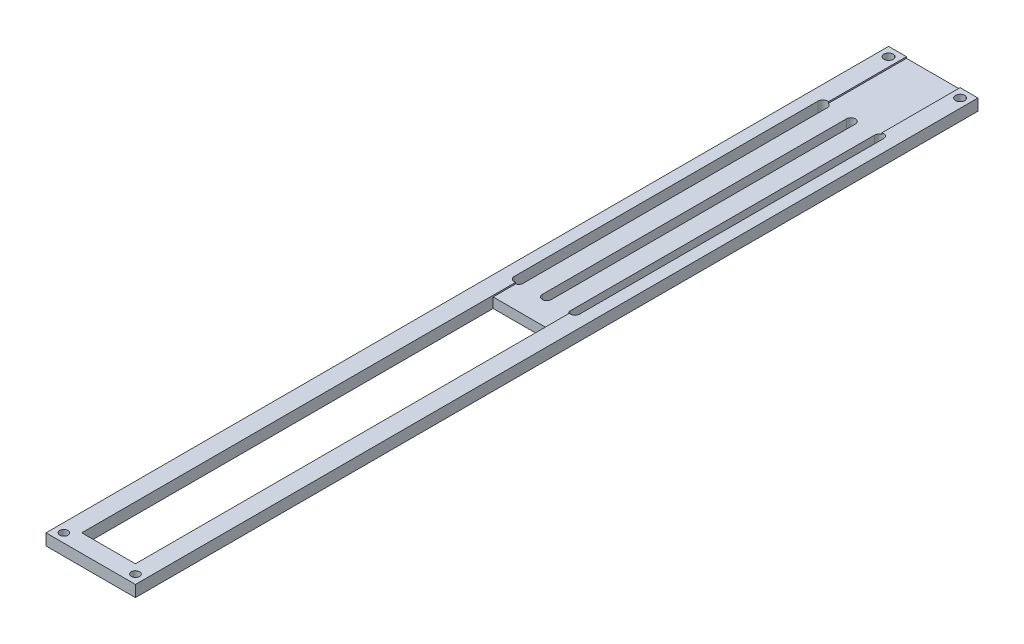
from build123d import *

# Parameters (mm, degrees)
SKETCH1_W                 = 31.75
SKETCH1_H                 = 4.064
BOSS_EXTRUDE1_DEPTH       = 308.6608
SKETCH2_W                 = 19.05
SKETCH2_H                 = 146.05
CUT_EXTRUDE2_DEPTH        = 6.35
SKETCH3_W                 = 19.05
SKETCH3_H                 = 154.533555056
CUT_EXTRUDE3_DEPTH        = 0.508
F_4_CLEARANCE_HOLE1_D     = 2.9464
F_4_CLEARANCE_HOLE1_DEPTH = 25.4
F_4_CLEARANCE_HOLE1_TIP   = 0.885187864
CUT_EXTRUDE4_DEPTH        = 8.128
LPATTERN1_COUNT           = 2
LPATTERN1_PITCH           = 10
LPATTERN2_COUNT           = 2
LPATTERN2_PITCH           = 10
F_4_CLEARANCE_HOLE2_D     = 3.2639
F_4_CLEARANCE_HOLE2_DEPTH = 25.4
F_4_CLEARANCE_HOLE2_TIP   = 0.980574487
SKETCH9_W                 = 36.705635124
SKETCH9_H                 = 8.678632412
CUT_EXTRUDE5_DEPTH        = 9.525


with BuildPart() as part:
    # Sketch1 → Boss-Extrude1 (new body)
    with BuildSketch(Plane.XY):
        Rectangle(SKETCH1_W, SKETCH1_H)
    extrude(amount=BOSS_EXTRUDE1_DEPTH)

    # Sketch2 → Cut-Extrude2 (cut)
    with BuildSketch(Plane(origin=(0, 2.032, 0), x_dir=(1, 0, 0), z_dir=(0, 1, 0))):
        with Locations((0, -219.7608)):
            Rectangle(SKETCH2_W, SKETCH2_H)
    extrude(amount=-CUT_EXTRUDE2_DEPTH, mode=Mode.SUBTRACT)

    # Sketch3 → Cut-Extrude3 (cut)
    with BuildSketch(Plane(origin=(0, 2.032, 0), x_dir=(1, 0, 0), z_dir=(0, 1, 0))):
        with Locations((0, -69.469022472)):
            Rectangle(SKETCH3_W, SKETCH3_H)
    extrude(amount=-CUT_EXTRUDE3_DEPTH, mode=Mode.SUBTRACT)

    # 4 Clearance Hole1
    with Locations(Plane(origin=(0, 2.032, 0), x_dir=(1, 0, 0), z_dir=(0, 1, 0))):
        with Locations((12.7, -295.9608), (-12.7, -295.9608)):
            Hole(F_4_CLEARANCE_HOLE1_D / 2, depth=F_4_CLEARANCE_HOLE1_DEPTH)
            with Locations((0, 0, -(F_4_CLEARANCE_HOLE1_DEPTH + F_4_CLEARANCE_HOLE1_TIP / 2))):  # 118° drill point
                Cone(0, F_4_CLEARANCE_HOLE1_D / 2, F_4_CLEARANCE_HOLE1_TIP, mode=Mode.SUBTRACT)

    # Sketch6 → Cut-Extrude4 (cut)
    with BuildSketch(Plane.XZ.offset(2.032)):
        with BuildLine():
            Line((1.614488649, 137.2108), (1.614488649, 29.2608))
            ThreePointArc((1.614488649, 29.2608), (0.014488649, 27.6608), (-1.585511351, 29.2608))
            Line((-1.585511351, 29.2608), (-1.585511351, 137.2108))
            ThreePointArc((-1.585511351, 137.2108), (0.014488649, 138.8108), (1.614488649, 137.2108))
        make_face()
    cut_extrude4 = extrude(amount=-CUT_EXTRUDE4_DEPTH, mode=Mode.SUBTRACT)

    # LPattern1: Cut-Extrude4 ×2
    with Locations(*[(-i * LPATTERN1_PITCH, 0, 0) for i in range(1, LPATTERN1_COUNT)]):
        add(cut_extrude4, mode=Mode.SUBTRACT)

    # LPattern2: Cut-Extrude4 ×2
    with Locations(*[(i * LPATTERN2_PITCH, 0, 0) for i in range(1, LPATTERN2_COUNT)]):
        add(cut_extrude4, mode=Mode.SUBTRACT)

    # 4 Clearance Hole2
    with Locations(Plane(origin=(0, 2.032, 0), x_dir=(1, 0, 0), z_dir=(0, 1, 0))):
        with Locations((12.7, -306.27955), (-12.7, -306.27955), (12.7, -3.175), (-12.7, -3.175)):
            Hole(F_4_CLEARANCE_HOLE2_D / 2, depth=F_4_CLEARANCE_HOLE2_DEPTH)
            with Locations((0, 0, -(F_4_CLEARANCE_HOLE2_DEPTH + F_4_CLEARANCE_HOLE2_TIP / 2))):  # 118° drill point
                Cone(0, F_4_CLEARANCE_HOLE2_D / 2, F_4_CLEARANCE_HOLE2_TIP, mode=Mode.SUBTRACT)

    # Sketch9 → Cut-Extrude5 (cut)
    with BuildSketch(Plane.XY.offset(308.6608)):
        Rectangle(SKETCH9_W, SKETCH9_H)
    extrude(amount=-CUT_EXTRUDE5_DEPTH, mode=Mode.SUBTRACT)


solid = part.part
